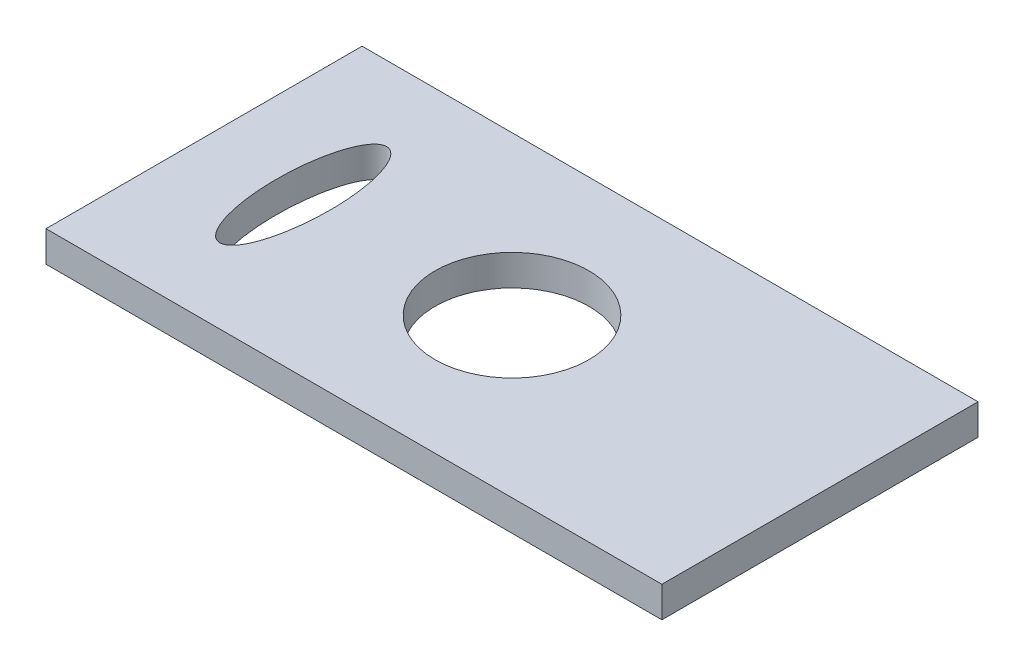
ISO-10303-21;
HEADER;
FILE_DESCRIPTION(('STEP AP214'),'2;1');
FILE_NAME('part.step','',(''),(''),'','','');
FILE_SCHEMA(('AUTOMOTIVE_DESIGN { 1 0 10303 214 1 1 1 1 }'));
ENDSEC;
DATA;
#1=APPLICATION_CONTEXT('core data for automotive mechanical design processes');
#2=APPLICATION_PROTOCOL_DEFINITION('international standard','automotive_design',2000,#1);
#3=PRODUCT_CONTEXT('',#1,'mechanical');
#4=PRODUCT('Part','Part','',(#3));
#5=PRODUCT_RELATED_PRODUCT_CATEGORY('part','',(#4));
#6=PRODUCT_DEFINITION_FORMATION('','',#4);
#7=PRODUCT_DEFINITION_CONTEXT('part definition',#1,'design');
#8=PRODUCT_DEFINITION('design','',#6,#7);
#9=PRODUCT_DEFINITION_SHAPE('','',#8);
#10=(LENGTH_UNIT() NAMED_UNIT(*) SI_UNIT(.MILLI.,.METRE.));
#11=(NAMED_UNIT(*) PLANE_ANGLE_UNIT() SI_UNIT($,.RADIAN.));
#12=(NAMED_UNIT(*) SI_UNIT($,.STERADIAN.) SOLID_ANGLE_UNIT());
#13=UNCERTAINTY_MEASURE_WITH_UNIT(LENGTH_MEASURE(1.E-05),#10,'distance_accuracy_value','');
#14=(GEOMETRIC_REPRESENTATION_CONTEXT(3) GLOBAL_UNCERTAINTY_ASSIGNED_CONTEXT((#13)) GLOBAL_UNIT_ASSIGNED_CONTEXT((#10,
#11,#12)) REPRESENTATION_CONTEXT('',''));
#15=CARTESIAN_POINT('',(0.,0.,0.));
#16=DIRECTION('',(0.,0.,1.));
#17=DIRECTION('',(1.,0.,0.));
#18=AXIS2_PLACEMENT_3D('',#15,#16,#17);
#19=CARTESIAN_POINT('',(0.,10.,0.));
#20=DIRECTION('',(0.,1.,0.));
#21=DIRECTION('',(0.,0.,1.));
#22=AXIS2_PLACEMENT_3D('',#19,#20,#21);
#23=PLANE('',#22);
#24=CARTESIAN_POINT('',(0.,10.,0.));
#25=DIRECTION('',(0.,1.,0.));
#26=DIRECTION('',(0.,0.,1.));
#27=AXIS2_PLACEMENT_3D('',#24,#25,#26);
#28=CIRCLE('',#27,25.);
#29=CARTESIAN_POINT('',(0.,10.,25.));
#30=VERTEX_POINT('',#29);
#31=EDGE_CURVE('E100',#30,#30,#28,.T.);
#32=ORIENTED_EDGE('',*,*,#31,.F.);
#33=EDGE_LOOP('',(#32));
#34=FACE_BOUND('',#33,.T.);
#35=DIRECTION('',(0.,0.,-1.));
#36=VECTOR('',#35,1.);
#37=CARTESIAN_POINT('',(100.,10.,-51.3257575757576));
#38=LINE('',#37,#36);
#39=CARTESIAN_POINT('',(100.,10.,51.3257575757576));
#40=VERTEX_POINT('',#39);
#41=CARTESIAN_POINT('',(100.,10.,-51.3257575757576));
#42=VERTEX_POINT('',#41);
#43=EDGE_CURVE('E85',#40,#42,#38,.T.);
#44=ORIENTED_EDGE('',*,*,#43,.T.);
#45=DIRECTION('',(-1.,0.,0.));
#46=VECTOR('',#45,1.);
#47=CARTESIAN_POINT('',(-100.,10.,-51.3257575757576));
#48=LINE('',#47,#46);
#49=CARTESIAN_POINT('',(-100.,10.,-51.3257575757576));
#50=VERTEX_POINT('',#49);
#51=EDGE_CURVE('E80',#42,#50,#48,.T.);
#52=ORIENTED_EDGE('',*,*,#51,.T.);
#53=DIRECTION('',(0.,0.,1.));
#54=VECTOR('',#53,1.);
#55=CARTESIAN_POINT('',(-100.,10.,-51.3257575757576));
#56=LINE('',#55,#54);
#57=CARTESIAN_POINT('',(-100.,10.,51.3257575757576));
#58=VERTEX_POINT('',#57);
#59=EDGE_CURVE('E83',#50,#58,#56,.T.);
#60=ORIENTED_EDGE('',*,*,#59,.T.);
#61=DIRECTION('',(1.,0.,0.));
#62=VECTOR('',#61,1.);
#63=CARTESIAN_POINT('',(-100.,10.,51.3257575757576));
#64=LINE('',#63,#62);
#65=EDGE_CURVE('E50',#58,#40,#64,.T.);
#66=ORIENTED_EDGE('',*,*,#65,.T.);
#67=EDGE_LOOP('',(#44,#52,#60,#66));
#68=FACE_BOUND('',#67,.T.);
#69=CARTESIAN_POINT('',(-67.8030303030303,10.,0.));
#70=DIRECTION('',(0.,1.,0.));
#71=DIRECTION('',(0.,0.,1.));
#72=AXIS2_PLACEMENT_3D('',#69,#70,#71);
#73=ELLIPSE('',#72,27.0833333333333,8.71212121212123);
#74=CARTESIAN_POINT('',(-67.8030303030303,10.,27.0833333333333));
#75=VERTEX_POINT('',#74);
#76=EDGE_CURVE('E115',#75,#75,#73,.T.);
#77=ORIENTED_EDGE('',*,*,#76,.F.);
#78=EDGE_LOOP('',(#77));
#79=FACE_BOUND('',#78,.T.);
#80=ADVANCED_FACE('F33',(#34,#68,#79),#23,.T.);
#81=CARTESIAN_POINT('',(0.,0.,0.));
#82=DIRECTION('',(0.,1.,0.));
#83=DIRECTION('',(0.,0.,1.));
#84=AXIS2_PLACEMENT_3D('',#81,#82,#83);
#85=PLANE('',#84);
#86=DIRECTION('',(0.,0.,-1.));
#87=VECTOR('',#86,1.);
#88=CARTESIAN_POINT('',(100.,0.,-51.3257575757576));
#89=LINE('',#88,#87);
#90=CARTESIAN_POINT('',(100.,0.,51.3257575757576));
#91=VERTEX_POINT('',#90);
#92=CARTESIAN_POINT('',(100.,0.,-51.3257575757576));
#93=VERTEX_POINT('',#92);
#94=EDGE_CURVE('E97',#91,#93,#89,.T.);
#95=ORIENTED_EDGE('',*,*,#94,.F.);
#96=DIRECTION('',(1.,0.,0.));
#97=VECTOR('',#96,1.);
#98=CARTESIAN_POINT('',(-100.,0.,51.3257575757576));
#99=LINE('',#98,#97);
#100=CARTESIAN_POINT('',(-100.,0.,51.3257575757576));
#101=VERTEX_POINT('',#100);
#102=EDGE_CURVE('E73',#101,#91,#99,.T.);
#103=ORIENTED_EDGE('',*,*,#102,.F.);
#104=DIRECTION('',(0.,0.,1.));
#105=VECTOR('',#104,1.);
#106=CARTESIAN_POINT('',(-100.,0.,-51.3257575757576));
#107=LINE('',#106,#105);
#108=CARTESIAN_POINT('',(-100.,0.,-51.3257575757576));
#109=VERTEX_POINT('',#108);
#110=EDGE_CURVE('E67',#109,#101,#107,.T.);
#111=ORIENTED_EDGE('',*,*,#110,.F.);
#112=DIRECTION('',(-1.,0.,0.));
#113=VECTOR('',#112,1.);
#114=CARTESIAN_POINT('',(-100.,0.,-51.3257575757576));
#115=LINE('',#114,#113);
#116=EDGE_CURVE('E89',#93,#109,#115,.T.);
#117=ORIENTED_EDGE('',*,*,#116,.F.);
#118=EDGE_LOOP('',(#95,#103,#111,#117));
#119=FACE_BOUND('',#118,.T.);
#120=CARTESIAN_POINT('',(0.,0.,0.));
#121=DIRECTION('',(0.,1.,0.));
#122=DIRECTION('',(0.,0.,1.));
#123=AXIS2_PLACEMENT_3D('',#120,#121,#122);
#124=CIRCLE('',#123,25.);
#125=CARTESIAN_POINT('',(0.,0.,25.));
#126=VERTEX_POINT('',#125);
#127=EDGE_CURVE('E112',#126,#126,#124,.T.);
#128=ORIENTED_EDGE('',*,*,#127,.T.);
#129=EDGE_LOOP('',(#128));
#130=FACE_BOUND('',#129,.T.);
#131=CARTESIAN_POINT('',(-67.8030303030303,0.,0.));
#132=DIRECTION('',(0.,1.,0.));
#133=DIRECTION('',(0.,0.,1.));
#134=AXIS2_PLACEMENT_3D('',#131,#132,#133);
#135=ELLIPSE('',#134,27.0833333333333,8.71212121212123);
#136=CARTESIAN_POINT('',(-67.8030303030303,0.,27.0833333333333));
#137=VERTEX_POINT('',#136);
#138=EDGE_CURVE('E118',#137,#137,#135,.T.);
#139=ORIENTED_EDGE('',*,*,#138,.T.);
#140=EDGE_LOOP('',(#139));
#141=FACE_BOUND('',#140,.T.);
#142=ADVANCED_FACE('F108',(#119,#130,#141),#85,.F.);
#143=CARTESIAN_POINT('',(100.,10.,-51.3257575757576));
#144=DIRECTION('',(-1.,0.,0.));
#145=DIRECTION('',(0.,0.,1.));
#146=AXIS2_PLACEMENT_3D('',#143,#144,#145);
#147=PLANE('',#146);
#148=ORIENTED_EDGE('',*,*,#94,.T.);
#149=DIRECTION('',(0.,-1.,0.));
#150=VECTOR('',#149,1.);
#151=CARTESIAN_POINT('',(100.,10.,-51.3257575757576));
#152=LINE('',#151,#150);
#153=EDGE_CURVE('E11',#42,#93,#152,.T.);
#154=ORIENTED_EDGE('',*,*,#153,.F.);
#155=ORIENTED_EDGE('',*,*,#43,.F.);
#156=DIRECTION('',(0.,-1.,0.));
#157=VECTOR('',#156,1.);
#158=CARTESIAN_POINT('',(100.,10.,51.3257575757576));
#159=LINE('',#158,#157);
#160=EDGE_CURVE('E93',#40,#91,#159,.T.);
#161=ORIENTED_EDGE('',*,*,#160,.T.);
#162=EDGE_LOOP('',(#148,#154,#155,#161));
#163=FACE_BOUND('',#162,.T.);
#164=ADVANCED_FACE('F35',(#163),#147,.F.);
#165=CARTESIAN_POINT('',(-100.,10.,-51.3257575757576));
#166=DIRECTION('',(0.,0.,1.));
#167=DIRECTION('',(1.,0.,0.));
#168=AXIS2_PLACEMENT_3D('',#165,#166,#167);
#169=PLANE('',#168);
#170=ORIENTED_EDGE('',*,*,#116,.T.);
#171=DIRECTION('',(0.,-1.,0.));
#172=VECTOR('',#171,1.);
#173=CARTESIAN_POINT('',(-100.,10.,-51.3257575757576));
#174=LINE('',#173,#172);
#175=EDGE_CURVE('E42',#50,#109,#174,.T.);
#176=ORIENTED_EDGE('',*,*,#175,.F.);
#177=ORIENTED_EDGE('',*,*,#51,.F.);
#178=ORIENTED_EDGE('',*,*,#153,.T.);
#179=EDGE_LOOP('',(#170,#176,#177,#178));
#180=FACE_BOUND('',#179,.T.);
#181=ADVANCED_FACE('F88',(#180),#169,.F.);
#182=CARTESIAN_POINT('',(-100.,10.,-51.3257575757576));
#183=DIRECTION('',(1.,0.,0.));
#184=DIRECTION('',(0.,0.,-1.));
#185=AXIS2_PLACEMENT_3D('',#182,#183,#184);
#186=PLANE('',#185);
#187=ORIENTED_EDGE('',*,*,#110,.T.);
#188=DIRECTION('',(0.,-1.,0.));
#189=VECTOR('',#188,1.);
#190=CARTESIAN_POINT('',(-100.,10.,51.3257575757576));
#191=LINE('',#190,#189);
#192=EDGE_CURVE('E90',#58,#101,#191,.T.);
#193=ORIENTED_EDGE('',*,*,#192,.F.);
#194=ORIENTED_EDGE('',*,*,#59,.F.);
#195=ORIENTED_EDGE('',*,*,#175,.T.);
#196=EDGE_LOOP('',(#187,#193,#194,#195));
#197=FACE_BOUND('',#196,.T.);
#198=ADVANCED_FACE('F91',(#197),#186,.F.);
#199=CARTESIAN_POINT('',(-100.,10.,51.3257575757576));
#200=DIRECTION('',(0.,0.,-1.));
#201=DIRECTION('',(-1.,0.,0.));
#202=AXIS2_PLACEMENT_3D('',#199,#200,#201);
#203=PLANE('',#202);
#204=ORIENTED_EDGE('',*,*,#102,.T.);
#205=ORIENTED_EDGE('',*,*,#160,.F.);
#206=ORIENTED_EDGE('',*,*,#65,.F.);
#207=ORIENTED_EDGE('',*,*,#192,.T.);
#208=EDGE_LOOP('',(#204,#205,#206,#207));
#209=FACE_BOUND('',#208,.T.);
#210=ADVANCED_FACE('F105',(#209),#203,.F.);
#211=CARTESIAN_POINT('',(0.,10.,0.));
#212=DIRECTION('',(0.,-1.,0.));
#213=DIRECTION('',(0.,0.,-1.));
#214=AXIS2_PLACEMENT_3D('',#211,#212,#213);
#215=CYLINDRICAL_SURFACE('',#214,25.);
#216=ORIENTED_EDGE('',*,*,#31,.T.);
#217=EDGE_LOOP('',(#216));
#218=FACE_BOUND('',#217,.T.);
#219=ORIENTED_EDGE('',*,*,#127,.F.);
#220=EDGE_LOOP('',(#219));
#221=FACE_BOUND('',#220,.T.);
#222=ADVANCED_FACE('F127',(#218,#221),#215,.F.);
#223=DIRECTION('',(0.,-1.,0.));
#224=VECTOR('',#223,1.);
#225=SURFACE_OF_LINEAR_EXTRUSION('',#73,#224);
#226=ORIENTED_EDGE('',*,*,#76,.T.);
#227=EDGE_LOOP('',(#226));
#228=FACE_BOUND('',#227,.T.);
#229=ORIENTED_EDGE('',*,*,#138,.F.);
#230=EDGE_LOOP('',(#229));
#231=FACE_BOUND('',#230,.T.);
#232=ADVANCED_FACE('F124',(#228,#231),#225,.T.);
#233=CLOSED_SHELL('',(#80,#142,#164,#181,#198,#210,#222,#232));
#234=MANIFOLD_SOLID_BREP('B2',#233);
#235=ADVANCED_BREP_SHAPE_REPRESENTATION('',(#18,#234),#14);
#236=SHAPE_DEFINITION_REPRESENTATION(#9,#235);
ENDSEC;
END-ISO-10303-21;
